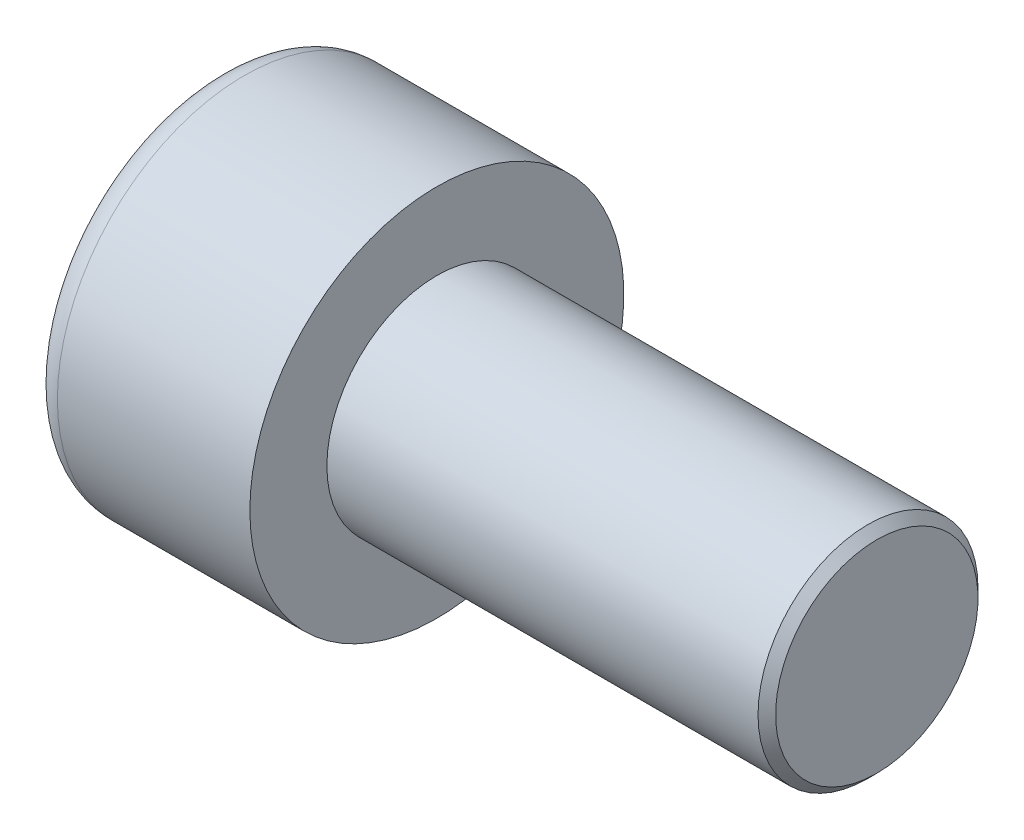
ISO-10303-21;
HEADER;
FILE_DESCRIPTION(('STEP AP214'),'2;1');
FILE_NAME('part.step','',(''),(''),'','','');
FILE_SCHEMA(('AUTOMOTIVE_DESIGN { 1 0 10303 214 1 1 1 1 }'));
ENDSEC;
DATA;
#1=APPLICATION_CONTEXT('core data for automotive mechanical design processes');
#2=APPLICATION_PROTOCOL_DEFINITION('international standard','automotive_design',2000,#1);
#3=PRODUCT_CONTEXT('',#1,'mechanical');
#4=PRODUCT('Part','Part','',(#3));
#5=PRODUCT_RELATED_PRODUCT_CATEGORY('part','',(#4));
#6=PRODUCT_DEFINITION_FORMATION('','',#4);
#7=PRODUCT_DEFINITION_CONTEXT('part definition',#1,'design');
#8=PRODUCT_DEFINITION('design','',#6,#7);
#9=PRODUCT_DEFINITION_SHAPE('','',#8);
#10=(LENGTH_UNIT() NAMED_UNIT(*) SI_UNIT(.MILLI.,.METRE.));
#11=(NAMED_UNIT(*) PLANE_ANGLE_UNIT() SI_UNIT($,.RADIAN.));
#12=(NAMED_UNIT(*) SI_UNIT($,.STERADIAN.) SOLID_ANGLE_UNIT());
#13=UNCERTAINTY_MEASURE_WITH_UNIT(LENGTH_MEASURE(1.E-05),#10,'distance_accuracy_value','');
#14=(GEOMETRIC_REPRESENTATION_CONTEXT(3) GLOBAL_UNCERTAINTY_ASSIGNED_CONTEXT((#13)) GLOBAL_UNIT_ASSIGNED_CONTEXT((#10,
#11,#12)) REPRESENTATION_CONTEXT('',''));
#15=CARTESIAN_POINT('',(0.,0.,0.));
#16=DIRECTION('',(0.,0.,1.));
#17=DIRECTION('',(1.,0.,0.));
#18=AXIS2_PLACEMENT_3D('',#15,#16,#17);
#19=CARTESIAN_POINT('',(2.5,-4.,0.));
#20=DIRECTION('',(-1.,0.,0.));
#21=DIRECTION('',(0.,0.,1.));
#22=AXIS2_PLACEMENT_3D('',#19,#20,#21);
#23=PLANE('',#22);
#24=CARTESIAN_POINT('',(2.49999999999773,0.,0.));
#25=DIRECTION('',(-1.,0.,0.));
#26=DIRECTION('',(0.,0.,1.));
#27=AXIS2_PLACEMENT_3D('',#24,#25,#26);
#28=CIRCLE('',#27,2.00000000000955);
#29=CARTESIAN_POINT('',(2.49999999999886,1.00000000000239,-1.73205080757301));
#30=VERTEX_POINT('',#29);
#31=CARTESIAN_POINT('',(2.49999999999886,2.00000000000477,0.));
#32=VERTEX_POINT('',#31);
#33=EDGE_CURVE('E112',#30,#32,#28,.F.);
#34=ORIENTED_EDGE('',*,*,#33,.T.);
#35=DIRECTION('',(0.,0.,1.));
#36=VECTOR('',#35,1.);
#37=CARTESIAN_POINT('',(2.5,2.,0.));
#38=LINE('',#37,#36);
#39=CARTESIAN_POINT('',(2.5,2.,-1.15470053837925));
#40=VERTEX_POINT('',#39);
#41=EDGE_CURVE('E81',#32,#40,#38,.F.);
#42=ORIENTED_EDGE('',*,*,#41,.T.);
#43=DIRECTION('',(0.,-0.866025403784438,-0.500000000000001));
#44=VECTOR('',#43,1.);
#45=CARTESIAN_POINT('',(2.5,2.,-1.15470053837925));
#46=LINE('',#45,#44);
#47=EDGE_CURVE('E104',#40,#30,#46,.T.);
#48=ORIENTED_EDGE('',*,*,#47,.T.);
#49=EDGE_LOOP('',(#34,#42,#48));
#50=FACE_BOUND('',#49,.T.);
#51=ADVANCED_FACE('F17',(#50),#23,.T.);
#52=CARTESIAN_POINT('',(2.5,-4.,0.));
#53=DIRECTION('',(-1.,0.,0.));
#54=DIRECTION('',(0.,0.,1.));
#55=AXIS2_PLACEMENT_3D('',#52,#53,#54);
#56=PLANE('',#55);
#57=CARTESIAN_POINT('',(2.49999999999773,0.,0.));
#58=DIRECTION('',(-1.,0.,0.));
#59=DIRECTION('',(0.,0.,1.));
#60=AXIS2_PLACEMENT_3D('',#57,#58,#59);
#61=CIRCLE('',#60,2.00000000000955);
#62=CARTESIAN_POINT('',(2.49999999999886,1.00000000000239,1.73205080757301));
#63=VERTEX_POINT('',#62);
#64=EDGE_CURVE('E118',#32,#63,#61,.F.);
#65=ORIENTED_EDGE('',*,*,#64,.T.);
#66=DIRECTION('',(0.,0.866025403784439,-0.5));
#67=VECTOR('',#66,1.);
#68=CARTESIAN_POINT('',(2.5,1.,1.73205080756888));
#69=LINE('',#68,#67);
#70=CARTESIAN_POINT('',(2.5,2.,1.15470053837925));
#71=VERTEX_POINT('',#70);
#72=EDGE_CURVE('E280',#63,#71,#69,.T.);
#73=ORIENTED_EDGE('',*,*,#72,.T.);
#74=DIRECTION('',(0.,0.,1.));
#75=VECTOR('',#74,1.);
#76=CARTESIAN_POINT('',(2.5,2.,0.));
#77=LINE('',#76,#75);
#78=EDGE_CURVE('E285',#71,#32,#77,.F.);
#79=ORIENTED_EDGE('',*,*,#78,.T.);
#80=EDGE_LOOP('',(#65,#73,#79));
#81=FACE_BOUND('',#80,.T.);
#82=ADVANCED_FACE('F325',(#81),#56,.T.);
#83=CARTESIAN_POINT('',(2.5,-4.,0.));
#84=DIRECTION('',(-1.,0.,0.));
#85=DIRECTION('',(0.,0.,1.));
#86=AXIS2_PLACEMENT_3D('',#83,#84,#85);
#87=PLANE('',#86);
#88=CARTESIAN_POINT('',(2.49999999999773,0.,0.));
#89=DIRECTION('',(-1.,0.,0.));
#90=DIRECTION('',(0.,0.,1.));
#91=AXIS2_PLACEMENT_3D('',#88,#89,#90);
#92=CIRCLE('',#91,2.00000000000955);
#93=CARTESIAN_POINT('',(2.49999999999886,-2.00000000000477,0.));
#94=VERTEX_POINT('',#93);
#95=CARTESIAN_POINT('',(2.49999999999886,-1.00000000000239,-1.73205080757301));
#96=VERTEX_POINT('',#95);
#97=EDGE_CURVE('E98',#94,#96,#92,.F.);
#98=ORIENTED_EDGE('',*,*,#97,.T.);
#99=DIRECTION('',(0.,-0.866025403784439,0.499999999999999));
#100=VECTOR('',#99,1.);
#101=CARTESIAN_POINT('',(2.5,-1.,-1.73205080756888));
#102=LINE('',#101,#100);
#103=CARTESIAN_POINT('',(2.5,-2.,-1.15470053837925));
#104=VERTEX_POINT('',#103);
#105=EDGE_CURVE('E119',#96,#104,#102,.T.);
#106=ORIENTED_EDGE('',*,*,#105,.T.);
#107=DIRECTION('',(0.,0.,1.));
#108=VECTOR('',#107,1.);
#109=CARTESIAN_POINT('',(2.5,-2.,0.));
#110=LINE('',#109,#108);
#111=EDGE_CURVE('E124',#104,#94,#110,.T.);
#112=ORIENTED_EDGE('',*,*,#111,.T.);
#113=EDGE_LOOP('',(#98,#106,#112));
#114=FACE_BOUND('',#113,.T.);
#115=ADVANCED_FACE('F336',(#114),#87,.T.);
#116=CARTESIAN_POINT('',(2.49999999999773,0.,0.));
#117=DIRECTION('',(-1.,0.,0.));
#118=DIRECTION('',(0.,0.,1.));
#119=AXIS2_PLACEMENT_3D('',#116,#117,#118);
#120=CONICAL_SURFACE('',#119,2.00000000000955,1.04719755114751);
#121=CARTESIAN_POINT('',(3.65470053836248,0.,0.));
#122=VERTEX_POINT('',#121);
#123=VERTEX_LOOP('',#122);
#124=FACE_BOUND('',#123,.T.);
#125=ORIENTED_EDGE('',*,*,#33,.F.);
#126=CARTESIAN_POINT('',(2.49999999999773,0.,0.));
#127=DIRECTION('',(-1.,0.,0.));
#128=DIRECTION('',(0.,0.,1.));
#129=AXIS2_PLACEMENT_3D('',#126,#127,#128);
#130=CIRCLE('',#129,2.00000000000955);
#131=EDGE_CURVE('E87',#96,#30,#130,.F.);
#132=ORIENTED_EDGE('',*,*,#131,.F.);
#133=ORIENTED_EDGE('',*,*,#97,.F.);
#134=CARTESIAN_POINT('',(2.49999999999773,0.,0.));
#135=DIRECTION('',(-1.,0.,0.));
#136=DIRECTION('',(0.,0.,1.));
#137=AXIS2_PLACEMENT_3D('',#134,#135,#136);
#138=CIRCLE('',#137,2.00000000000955);
#139=CARTESIAN_POINT('',(2.49999999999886,-1.00000000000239,1.73205080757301));
#140=VERTEX_POINT('',#139);
#141=EDGE_CURVE('E97',#140,#94,#138,.F.);
#142=ORIENTED_EDGE('',*,*,#141,.F.);
#143=CARTESIAN_POINT('',(2.49999999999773,0.,0.));
#144=DIRECTION('',(-1.,0.,0.));
#145=DIRECTION('',(0.,0.,1.));
#146=AXIS2_PLACEMENT_3D('',#143,#144,#145);
#147=CIRCLE('',#146,2.00000000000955);
#148=EDGE_CURVE('E121',#63,#140,#147,.F.);
#149=ORIENTED_EDGE('',*,*,#148,.F.);
#150=ORIENTED_EDGE('',*,*,#64,.F.);
#151=EDGE_LOOP('',(#125,#132,#133,#142,#149,#150));
#152=FACE_BOUND('',#151,.T.);
#153=ADVANCED_FACE('F116',(#124,#152),#120,.F.);
#154=CARTESIAN_POINT('',(2.5,-4.,0.));
#155=DIRECTION('',(-1.,0.,0.));
#156=DIRECTION('',(0.,0.,1.));
#157=AXIS2_PLACEMENT_3D('',#154,#155,#156);
#158=PLANE('',#157);
#159=ORIENTED_EDGE('',*,*,#141,.T.);
#160=DIRECTION('',(0.,0.,1.));
#161=VECTOR('',#160,1.);
#162=CARTESIAN_POINT('',(2.5,-2.,1.15470053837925));
#163=LINE('',#162,#161);
#164=CARTESIAN_POINT('',(2.5,-2.,1.15470053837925));
#165=VERTEX_POINT('',#164);
#166=EDGE_CURVE('E235',#165,#94,#163,.F.);
#167=ORIENTED_EDGE('',*,*,#166,.F.);
#168=DIRECTION('',(0.,0.866025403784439,0.5));
#169=VECTOR('',#168,1.);
#170=CARTESIAN_POINT('',(2.5,0.,2.3094010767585));
#171=LINE('',#170,#169);
#172=EDGE_CURVE('E252',#140,#165,#171,.F.);
#173=ORIENTED_EDGE('',*,*,#172,.F.);
#174=EDGE_LOOP('',(#159,#167,#173));
#175=FACE_BOUND('',#174,.T.);
#176=ADVANCED_FACE('F253',(#175),#158,.T.);
#177=CARTESIAN_POINT('',(2.5,-4.,0.));
#178=DIRECTION('',(-1.,0.,0.));
#179=DIRECTION('',(0.,0.,1.));
#180=AXIS2_PLACEMENT_3D('',#177,#178,#179);
#181=PLANE('',#180);
#182=ORIENTED_EDGE('',*,*,#148,.T.);
#183=DIRECTION('',(0.,0.866025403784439,0.5));
#184=VECTOR('',#183,1.);
#185=CARTESIAN_POINT('',(2.5,0.,2.3094010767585));
#186=LINE('',#185,#184);
#187=CARTESIAN_POINT('',(2.5,0.,2.3094010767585));
#188=VERTEX_POINT('',#187);
#189=EDGE_CURVE('E243',#188,#140,#186,.F.);
#190=ORIENTED_EDGE('',*,*,#189,.F.);
#191=DIRECTION('',(0.,0.866025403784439,-0.5));
#192=VECTOR('',#191,1.);
#193=CARTESIAN_POINT('',(2.5,2.,1.15470053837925));
#194=LINE('',#193,#192);
#195=EDGE_CURVE('E246',#63,#188,#194,.F.);
#196=ORIENTED_EDGE('',*,*,#195,.F.);
#197=EDGE_LOOP('',(#182,#190,#196));
#198=FACE_BOUND('',#197,.T.);
#199=ADVANCED_FACE('F241',(#198),#181,.T.);
#200=CARTESIAN_POINT('',(2.5,-4.,0.));
#201=DIRECTION('',(-1.,0.,0.));
#202=DIRECTION('',(0.,0.,1.));
#203=AXIS2_PLACEMENT_3D('',#200,#201,#202);
#204=PLANE('',#203);
#205=ORIENTED_EDGE('',*,*,#131,.T.);
#206=DIRECTION('',(0.,-0.866025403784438,-0.5));
#207=VECTOR('',#206,1.);
#208=CARTESIAN_POINT('',(2.5,0.,-2.3094010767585));
#209=LINE('',#208,#207);
#210=CARTESIAN_POINT('',(2.5,0.,-2.3094010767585));
#211=VERTEX_POINT('',#210);
#212=EDGE_CURVE('E90',#211,#30,#209,.F.);
#213=ORIENTED_EDGE('',*,*,#212,.F.);
#214=DIRECTION('',(0.,-0.866025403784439,0.5));
#215=VECTOR('',#214,1.);
#216=CARTESIAN_POINT('',(2.5,-2.,-1.15470053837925));
#217=LINE('',#216,#215);
#218=EDGE_CURVE('E93',#96,#211,#217,.F.);
#219=ORIENTED_EDGE('',*,*,#218,.F.);
#220=EDGE_LOOP('',(#205,#213,#219));
#221=FACE_BOUND('',#220,.T.);
#222=ADVANCED_FACE('F89',(#221),#204,.T.);
#223=CARTESIAN_POINT('',(2.5,-2.,1.15470053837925));
#224=DIRECTION('',(0.,1.,0.));
#225=DIRECTION('',(0.,0.,1.));
#226=AXIS2_PLACEMENT_3D('',#223,#224,#225);
#227=PLANE('',#226);
#228=ORIENTED_EDGE('',*,*,#111,.F.);
#229=DIRECTION('',(1.,0.,0.));
#230=VECTOR('',#229,1.);
#231=CARTESIAN_POINT('',(2.5,-2.,-1.15470053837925));
#232=LINE('',#231,#230);
#233=CARTESIAN_POINT('',(0.,-2.,-1.15470053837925));
#234=VERTEX_POINT('',#233);
#235=EDGE_CURVE('E296',#234,#104,#232,.T.);
#236=ORIENTED_EDGE('',*,*,#235,.F.);
#237=DIRECTION('',(0.,0.,-1.));
#238=VECTOR('',#237,1.);
#239=CARTESIAN_POINT('',(0.,-2.,0.));
#240=LINE('',#239,#238);
#241=CARTESIAN_POINT('',(0.,-2.,1.15470053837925));
#242=VERTEX_POINT('',#241);
#243=EDGE_CURVE('E155',#234,#242,#240,.F.);
#244=ORIENTED_EDGE('',*,*,#243,.T.);
#245=DIRECTION('',(1.,0.,0.));
#246=VECTOR('',#245,1.);
#247=CARTESIAN_POINT('',(2.5,-2.,1.15470053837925));
#248=LINE('',#247,#246);
#249=EDGE_CURVE('E257',#165,#242,#248,.F.);
#250=ORIENTED_EDGE('',*,*,#249,.F.);
#251=ORIENTED_EDGE('',*,*,#166,.T.);
#252=EDGE_LOOP('',(#228,#236,#244,#250,#251));
#253=FACE_BOUND('',#252,.T.);
#254=ADVANCED_FACE('F319',(#253),#227,.T.);
#255=CARTESIAN_POINT('',(2.5,0.,2.3094010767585));
#256=DIRECTION('',(0.,0.5,-0.866025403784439));
#257=DIRECTION('',(0.,0.866025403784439,0.5));
#258=AXIS2_PLACEMENT_3D('',#255,#256,#257);
#259=PLANE('',#258);
#260=ORIENTED_EDGE('',*,*,#172,.T.);
#261=ORIENTED_EDGE('',*,*,#249,.T.);
#262=DIRECTION('',(0.,0.866025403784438,0.5));
#263=VECTOR('',#262,1.);
#264=CARTESIAN_POINT('',(0.,-2.,1.15470053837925));
#265=LINE('',#264,#263);
#266=CARTESIAN_POINT('',(0.,0.,2.3094010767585));
#267=VERTEX_POINT('',#266);
#268=EDGE_CURVE('E152',#242,#267,#265,.T.);
#269=ORIENTED_EDGE('',*,*,#268,.T.);
#270=DIRECTION('',(1.,0.,0.));
#271=VECTOR('',#270,1.);
#272=CARTESIAN_POINT('',(2.5,0.,2.3094010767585));
#273=LINE('',#272,#271);
#274=EDGE_CURVE('E261',#188,#267,#273,.F.);
#275=ORIENTED_EDGE('',*,*,#274,.F.);
#276=ORIENTED_EDGE('',*,*,#189,.T.);
#277=EDGE_LOOP('',(#260,#261,#269,#275,#276));
#278=FACE_BOUND('',#277,.T.);
#279=ADVANCED_FACE('F259',(#278),#259,.T.);
#280=CARTESIAN_POINT('',(2.5,2.,1.15470053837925));
#281=DIRECTION('',(0.,-0.5,-0.866025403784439));
#282=DIRECTION('',(0.,0.866025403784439,-0.5));
#283=AXIS2_PLACEMENT_3D('',#280,#281,#282);
#284=PLANE('',#283);
#285=ORIENTED_EDGE('',*,*,#195,.T.);
#286=ORIENTED_EDGE('',*,*,#274,.T.);
#287=DIRECTION('',(0.,0.866025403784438,-0.5));
#288=VECTOR('',#287,1.);
#289=CARTESIAN_POINT('',(0.,0.,2.3094010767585));
#290=LINE('',#289,#288);
#291=CARTESIAN_POINT('',(0.,2.,1.15470053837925));
#292=VERTEX_POINT('',#291);
#293=EDGE_CURVE('E149',#267,#292,#290,.T.);
#294=ORIENTED_EDGE('',*,*,#293,.T.);
#295=DIRECTION('',(1.,0.,0.));
#296=VECTOR('',#295,1.);
#297=CARTESIAN_POINT('',(2.5,2.,1.15470053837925));
#298=LINE('',#297,#296);
#299=EDGE_CURVE('E109',#71,#292,#298,.F.);
#300=ORIENTED_EDGE('',*,*,#299,.F.);
#301=ORIENTED_EDGE('',*,*,#72,.F.);
#302=EDGE_LOOP('',(#285,#286,#294,#300,#301));
#303=FACE_BOUND('',#302,.T.);
#304=ADVANCED_FACE('F322',(#303),#284,.T.);
#305=CARTESIAN_POINT('',(2.5,2.,-1.15470053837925));
#306=DIRECTION('',(0.,-1.,0.));
#307=DIRECTION('',(0.,0.,-1.));
#308=AXIS2_PLACEMENT_3D('',#305,#306,#307);
#309=PLANE('',#308);
#310=ORIENTED_EDGE('',*,*,#78,.F.);
#311=ORIENTED_EDGE('',*,*,#299,.T.);
#312=DIRECTION('',(0.,0.,-1.));
#313=VECTOR('',#312,1.);
#314=CARTESIAN_POINT('',(0.,2.,0.));
#315=LINE('',#314,#313);
#316=CARTESIAN_POINT('',(0.,2.,-1.15470053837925));
#317=VERTEX_POINT('',#316);
#318=EDGE_CURVE('E140',#292,#317,#315,.T.);
#319=ORIENTED_EDGE('',*,*,#318,.T.);
#320=DIRECTION('',(1.,0.,0.));
#321=VECTOR('',#320,1.);
#322=CARTESIAN_POINT('',(2.5,2.,-1.15470053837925));
#323=LINE('',#322,#321);
#324=EDGE_CURVE('E108',#40,#317,#323,.F.);
#325=ORIENTED_EDGE('',*,*,#324,.F.);
#326=ORIENTED_EDGE('',*,*,#41,.F.);
#327=EDGE_LOOP('',(#310,#311,#319,#325,#326));
#328=FACE_BOUND('',#327,.T.);
#329=ADVANCED_FACE('F323',(#328),#309,.T.);
#330=CARTESIAN_POINT('',(2.5,0.,-2.3094010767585));
#331=DIRECTION('',(0.,-0.5,0.866025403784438));
#332=DIRECTION('',(0.,-0.866025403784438,-0.5));
#333=AXIS2_PLACEMENT_3D('',#330,#331,#332);
#334=PLANE('',#333);
#335=ORIENTED_EDGE('',*,*,#47,.F.);
#336=ORIENTED_EDGE('',*,*,#324,.T.);
#337=DIRECTION('',(0.,-0.866025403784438,-0.5));
#338=VECTOR('',#337,1.);
#339=CARTESIAN_POINT('',(0.,2.,-1.15470053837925));
#340=LINE('',#339,#338);
#341=CARTESIAN_POINT('',(0.,0.,-2.3094010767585));
#342=VERTEX_POINT('',#341);
#343=EDGE_CURVE('E134',#317,#342,#340,.T.);
#344=ORIENTED_EDGE('',*,*,#343,.T.);
#345=DIRECTION('',(1.,0.,0.));
#346=VECTOR('',#345,1.);
#347=CARTESIAN_POINT('',(2.5,0.,-2.3094010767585));
#348=LINE('',#347,#346);
#349=EDGE_CURVE('E107',#211,#342,#348,.F.);
#350=ORIENTED_EDGE('',*,*,#349,.F.);
#351=ORIENTED_EDGE('',*,*,#212,.T.);
#352=EDGE_LOOP('',(#335,#336,#344,#350,#351));
#353=FACE_BOUND('',#352,.T.);
#354=ADVANCED_FACE('F102',(#353),#334,.T.);
#355=CARTESIAN_POINT('',(2.5,-2.,-1.15470053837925));
#356=DIRECTION('',(0.,0.5,0.866025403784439));
#357=DIRECTION('',(0.,-0.866025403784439,0.5));
#358=AXIS2_PLACEMENT_3D('',#355,#356,#357);
#359=PLANE('',#358);
#360=ORIENTED_EDGE('',*,*,#218,.T.);
#361=ORIENTED_EDGE('',*,*,#349,.T.);
#362=DIRECTION('',(0.,-0.866025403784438,0.5));
#363=VECTOR('',#362,1.);
#364=CARTESIAN_POINT('',(0.,0.,-2.3094010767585));
#365=LINE('',#364,#363);
#366=EDGE_CURVE('E131',#342,#234,#365,.T.);
#367=ORIENTED_EDGE('',*,*,#366,.T.);
#368=ORIENTED_EDGE('',*,*,#235,.T.);
#369=ORIENTED_EDGE('',*,*,#105,.F.);
#370=EDGE_LOOP('',(#360,#361,#367,#368,#369));
#371=FACE_BOUND('',#370,.T.);
#372=ADVANCED_FACE('F191',(#371),#359,.T.);
#373=CARTESIAN_POINT('',(0.,0.,0.));
#374=DIRECTION('',(1.,0.,0.));
#375=DIRECTION('',(0.,0.,-1.));
#376=AXIS2_PLACEMENT_3D('',#373,#374,#375);
#377=PLANE('',#376);
#378=ORIENTED_EDGE('',*,*,#343,.F.);
#379=ORIENTED_EDGE('',*,*,#318,.F.);
#380=ORIENTED_EDGE('',*,*,#293,.F.);
#381=ORIENTED_EDGE('',*,*,#268,.F.);
#382=ORIENTED_EDGE('',*,*,#243,.F.);
#383=ORIENTED_EDGE('',*,*,#366,.F.);
#384=EDGE_LOOP('',(#378,#379,#380,#381,#382,#383));
#385=FACE_BOUND('',#384,.T.);
#386=CARTESIAN_POINT('',(0.,0.,0.));
#387=DIRECTION('',(1.,0.,0.));
#388=DIRECTION('',(0.,0.,-1.));
#389=AXIS2_PLACEMENT_3D('',#386,#387,#388);
#390=CIRCLE('',#389,3.625);
#391=CARTESIAN_POINT('',(0.,0.,-3.625));
#392=VERTEX_POINT('',#391);
#393=CARTESIAN_POINT('',(0.,0.,3.625));
#394=VERTEX_POINT('',#393);
#395=EDGE_CURVE('E129',#392,#394,#390,.T.);
#396=ORIENTED_EDGE('',*,*,#395,.F.);
#397=CARTESIAN_POINT('',(0.,0.,0.));
#398=DIRECTION('',(1.,0.,0.));
#399=DIRECTION('',(0.,0.,1.));
#400=AXIS2_PLACEMENT_3D('',#397,#398,#399);
#401=CIRCLE('',#400,3.625);
#402=EDGE_CURVE('E36',#394,#392,#401,.T.);
#403=ORIENTED_EDGE('',*,*,#402,.F.);
#404=EDGE_LOOP('',(#396,#403));
#405=FACE_BOUND('',#404,.T.);
#406=ADVANCED_FACE('F172',(#385,#405),#377,.F.);
#407=CARTESIAN_POINT('',(0.625,0.,0.));
#408=DIRECTION('',(1.,0.,0.));
#409=DIRECTION('',(0.,0.,-1.));
#410=AXIS2_PLACEMENT_3D('',#407,#408,#409);
#411=TOROIDAL_SURFACE('',#410,3.625,0.625);
#412=CARTESIAN_POINT('',(0.625,0.,0.));
#413=DIRECTION('',(-1.,0.,0.));
#414=DIRECTION('',(0.,0.,1.));
#415=AXIS2_PLACEMENT_3D('',#412,#413,#414);
#416=CIRCLE('',#415,4.25);
#417=CARTESIAN_POINT('',(0.625,0.,4.25));
#418=VERTEX_POINT('',#417);
#419=EDGE_CURVE('E132',#418,#418,#416,.F.);
#420=ORIENTED_EDGE('',*,*,#419,.F.);
#421=EDGE_LOOP('',(#420));
#422=FACE_BOUND('',#421,.T.);
#423=ORIENTED_EDGE('',*,*,#395,.T.);
#424=ORIENTED_EDGE('',*,*,#402,.T.);
#425=EDGE_LOOP('',(#423,#424));
#426=FACE_BOUND('',#425,.T.);
#427=ADVANCED_FACE('F128',(#422,#426),#411,.T.);
#428=CARTESIAN_POINT('',(15.,0.,0.));
#429=DIRECTION('',(1.,0.,0.));
#430=DIRECTION('',(0.,0.,-1.));
#431=AXIS2_PLACEMENT_3D('',#428,#429,#430);
#432=PLANE('',#431);
#433=CARTESIAN_POINT('',(14.9999999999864,0.,0.));
#434=DIRECTION('',(-1.,0.,0.));
#435=DIRECTION('',(0.,-1.,0.));
#436=AXIS2_PLACEMENT_3D('',#433,#434,#435);
#437=CIRCLE('',#436,2.2999999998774);
#438=CARTESIAN_POINT('',(14.9999999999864,-2.2999999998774,0.));
#439=VERTEX_POINT('',#438);
#440=EDGE_CURVE('E227',#439,#439,#437,.T.);
#441=ORIENTED_EDGE('',*,*,#440,.F.);
#442=EDGE_LOOP('',(#441));
#443=FACE_BOUND('',#442,.T.);
#444=ADVANCED_FACE('F171',(#443),#432,.T.);
#445=CARTESIAN_POINT('',(5.,0.,0.));
#446=DIRECTION('',(-1.,0.,0.));
#447=DIRECTION('',(0.,0.,1.));
#448=AXIS2_PLACEMENT_3D('',#445,#446,#447);
#449=CYLINDRICAL_SURFACE('',#448,4.25);
#450=ORIENTED_EDGE('',*,*,#419,.T.);
#451=EDGE_LOOP('',(#450));
#452=FACE_BOUND('',#451,.T.);
#453=CARTESIAN_POINT('',(5.,0.,0.));
#454=DIRECTION('',(-1.,0.,0.));
#455=DIRECTION('',(0.,0.,1.));
#456=AXIS2_PLACEMENT_3D('',#453,#454,#455);
#457=CIRCLE('',#456,4.25);
#458=CARTESIAN_POINT('',(5.,0.,4.25));
#459=VERTEX_POINT('',#458);
#460=EDGE_CURVE('E225',#459,#459,#457,.F.);
#461=ORIENTED_EDGE('',*,*,#460,.F.);
#462=EDGE_LOOP('',(#461));
#463=FACE_BOUND('',#462,.T.);
#464=ADVANCED_FACE('F212',(#452,#463),#449,.T.);
#465=CARTESIAN_POINT('',(14.7999999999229,0.,0.));
#466=DIRECTION('',(-1.,0.,0.));
#467=DIRECTION('',(0.,-1.,0.));
#468=AXIS2_PLACEMENT_3D('',#465,#466,#467);
#469=CONICAL_SURFACE('',#468,2.49999999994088,0.785398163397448);
#470=CARTESIAN_POINT('',(14.8,0.,0.));
#471=DIRECTION('',(-1.,0.,0.));
#472=DIRECTION('',(0.,0.,1.));
#473=AXIS2_PLACEMENT_3D('',#470,#471,#472);
#474=CIRCLE('',#473,2.5);
#475=CARTESIAN_POINT('',(14.8,0.,2.5));
#476=VERTEX_POINT('',#475);
#477=EDGE_CURVE('E28',#476,#476,#474,.T.);
#478=ORIENTED_EDGE('',*,*,#477,.F.);
#479=EDGE_LOOP('',(#478));
#480=FACE_BOUND('',#479,.T.);
#481=ORIENTED_EDGE('',*,*,#440,.T.);
#482=EDGE_LOOP('',(#481));
#483=FACE_BOUND('',#482,.T.);
#484=ADVANCED_FACE('F206',(#480,#483),#469,.T.);
#485=CARTESIAN_POINT('',(5.,0.,0.));
#486=DIRECTION('',(1.,0.,0.));
#487=DIRECTION('',(0.,0.,-1.));
#488=AXIS2_PLACEMENT_3D('',#485,#486,#487);
#489=PLANE('',#488);
#490=CARTESIAN_POINT('',(5.,0.,0.));
#491=DIRECTION('',(-1.,0.,0.));
#492=DIRECTION('',(0.,0.,1.));
#493=AXIS2_PLACEMENT_3D('',#490,#491,#492);
#494=CIRCLE('',#493,2.5);
#495=CARTESIAN_POINT('',(5.,0.,2.5));
#496=VERTEX_POINT('',#495);
#497=EDGE_CURVE('E11',#496,#496,#494,.F.);
#498=ORIENTED_EDGE('',*,*,#497,.F.);
#499=EDGE_LOOP('',(#498));
#500=FACE_BOUND('',#499,.T.);
#501=ORIENTED_EDGE('',*,*,#460,.T.);
#502=EDGE_LOOP('',(#501));
#503=FACE_BOUND('',#502,.T.);
#504=ADVANCED_FACE('F200',(#500,#503),#489,.T.);
#505=CARTESIAN_POINT('',(15.,0.,0.));
#506=DIRECTION('',(-1.,0.,0.));
#507=DIRECTION('',(0.,0.,1.));
#508=AXIS2_PLACEMENT_3D('',#505,#506,#507);
#509=CYLINDRICAL_SURFACE('',#508,2.5);
#510=ORIENTED_EDGE('',*,*,#497,.T.);
#511=EDGE_LOOP('',(#510));
#512=FACE_BOUND('',#511,.T.);
#513=ORIENTED_EDGE('',*,*,#477,.T.);
#514=EDGE_LOOP('',(#513));
#515=FACE_BOUND('',#514,.T.);
#516=ADVANCED_FACE('F198',(#512,#515),#509,.T.);
#517=CLOSED_SHELL('',(#51,#82,#115,#153,#176,#199,#222,#254,#279,#304,#329,#354,#372,#406,#427,
#444,#464,#484,#504,#516));
#518=MANIFOLD_SOLID_BREP('B1',#517);
#519=ADVANCED_BREP_SHAPE_REPRESENTATION('',(#18,#518),#14);
#520=SHAPE_DEFINITION_REPRESENTATION(#9,#519);
ENDSEC;
END-ISO-10303-21;
